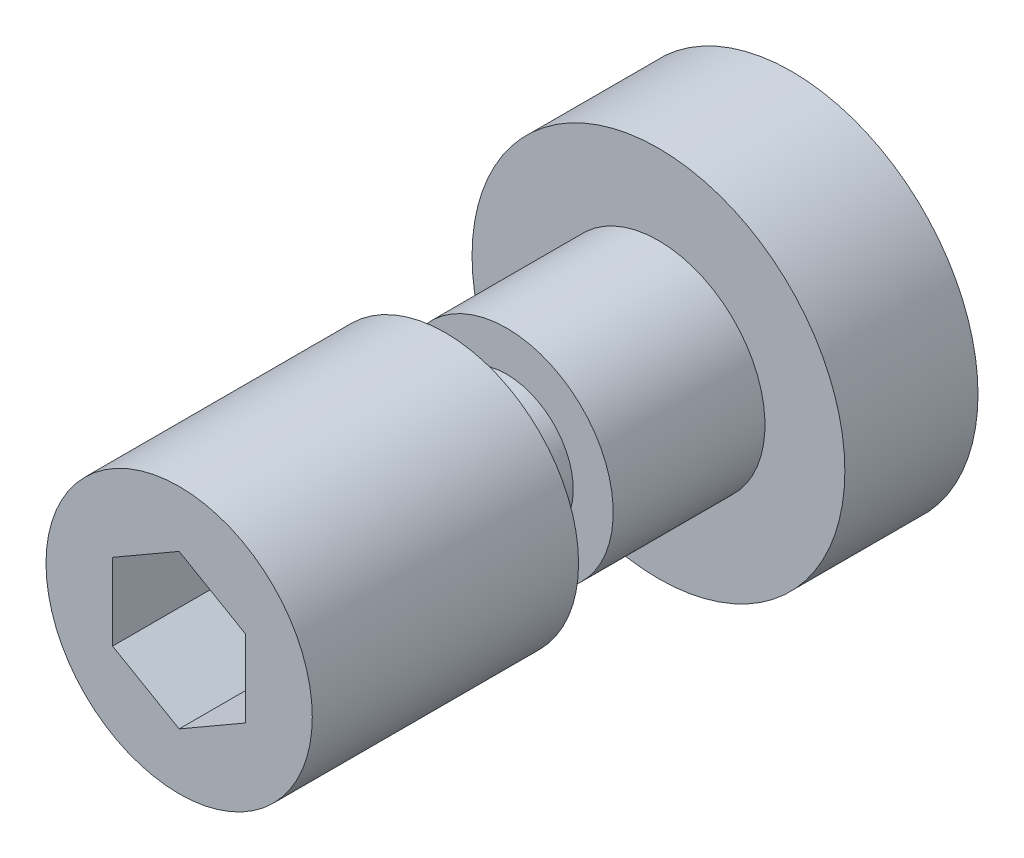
ISO-10303-21;
HEADER;
FILE_DESCRIPTION(('STEP AP214'),'2;1');
FILE_NAME('part.step','',(''),(''),'','','');
FILE_SCHEMA(('AUTOMOTIVE_DESIGN { 1 0 10303 214 1 1 1 1 }'));
ENDSEC;
DATA;
#1=APPLICATION_CONTEXT('core data for automotive mechanical design processes');
#2=APPLICATION_PROTOCOL_DEFINITION('international standard','automotive_design',2000,#1);
#3=PRODUCT_CONTEXT('',#1,'mechanical');
#4=PRODUCT('Part','Part','',(#3));
#5=PRODUCT_RELATED_PRODUCT_CATEGORY('part','',(#4));
#6=PRODUCT_DEFINITION_FORMATION('','',#4);
#7=PRODUCT_DEFINITION_CONTEXT('part definition',#1,'design');
#8=PRODUCT_DEFINITION('design','',#6,#7);
#9=PRODUCT_DEFINITION_SHAPE('','',#8);
#10=(LENGTH_UNIT() NAMED_UNIT(*) SI_UNIT(.MILLI.,.METRE.));
#11=(NAMED_UNIT(*) PLANE_ANGLE_UNIT() SI_UNIT($,.RADIAN.));
#12=(NAMED_UNIT(*) SI_UNIT($,.STERADIAN.) SOLID_ANGLE_UNIT());
#13=UNCERTAINTY_MEASURE_WITH_UNIT(LENGTH_MEASURE(1.E-05),#10,'distance_accuracy_value','');
#14=(GEOMETRIC_REPRESENTATION_CONTEXT(3) GLOBAL_UNCERTAINTY_ASSIGNED_CONTEXT((#13)) GLOBAL_UNIT_ASSIGNED_CONTEXT((#10,
#11,#12)) REPRESENTATION_CONTEXT('',''));
#15=CARTESIAN_POINT('',(0.,0.,0.));
#16=DIRECTION('',(0.,0.,1.));
#17=DIRECTION('',(1.,0.,0.));
#18=AXIS2_PLACEMENT_3D('',#15,#16,#17);
#19=CARTESIAN_POINT('',(0.,0.,0.));
#20=DIRECTION('',(0.,0.,1.));
#21=DIRECTION('',(0.,1.,0.));
#22=AXIS2_PLACEMENT_3D('',#19,#20,#21);
#23=PLANE('',#22);
#24=CARTESIAN_POINT('',(0.,0.,0.));
#25=DIRECTION('',(0.,0.,1.));
#26=DIRECTION('',(0.,1.,0.));
#27=AXIS2_PLACEMENT_3D('',#24,#25,#26);
#28=CIRCLE('',#27,7.);
#29=CARTESIAN_POINT('',(0.,7.,0.));
#30=VERTEX_POINT('',#29);
#31=EDGE_CURVE('E9',#30,#30,#28,.T.);
#32=ORIENTED_EDGE('',*,*,#31,.F.);
#33=EDGE_LOOP('',(#32));
#34=FACE_BOUND('',#33,.T.);
#35=ADVANCED_FACE('F14',(#34),#23,.F.);
#36=CARTESIAN_POINT('',(0.,0.,40.));
#37=DIRECTION('',(0.,0.,1.));
#38=DIRECTION('',(0.,1.,0.));
#39=AXIS2_PLACEMENT_3D('',#36,#37,#38);
#40=CYLINDRICAL_SURFACE('',#39,7.);
#41=CARTESIAN_POINT('',(0.,0.,5.));
#42=DIRECTION('',(0.,0.,1.));
#43=DIRECTION('',(0.,1.,0.));
#44=AXIS2_PLACEMENT_3D('',#41,#42,#43);
#45=CIRCLE('',#44,7.);
#46=CARTESIAN_POINT('',(0.,7.,5.));
#47=VERTEX_POINT('',#46);
#48=EDGE_CURVE('E21',#47,#47,#45,.T.);
#49=ORIENTED_EDGE('',*,*,#48,.F.);
#50=EDGE_LOOP('',(#49));
#51=FACE_BOUND('',#50,.T.);
#52=ORIENTED_EDGE('',*,*,#31,.T.);
#53=EDGE_LOOP('',(#52));
#54=FACE_BOUND('',#53,.T.);
#55=ADVANCED_FACE('F142',(#51,#54),#40,.T.);
#56=CARTESIAN_POINT('',(0.,-7.,5.));
#57=DIRECTION('',(0.,0.,-1.));
#58=DIRECTION('',(0.,-1.,0.));
#59=AXIS2_PLACEMENT_3D('',#56,#57,#58);
#60=PLANE('',#59);
#61=CARTESIAN_POINT('',(0.,0.,5.));
#62=DIRECTION('',(0.,0.,1.));
#63=DIRECTION('',(0.,1.,0.));
#64=AXIS2_PLACEMENT_3D('',#61,#62,#63);
#65=CIRCLE('',#64,4.);
#66=CARTESIAN_POINT('',(0.,4.,5.));
#67=VERTEX_POINT('',#66);
#68=EDGE_CURVE('E135',#67,#67,#65,.T.);
#69=ORIENTED_EDGE('',*,*,#68,.F.);
#70=EDGE_LOOP('',(#69));
#71=FACE_BOUND('',#70,.T.);
#72=ORIENTED_EDGE('',*,*,#48,.T.);
#73=EDGE_LOOP('',(#72));
#74=FACE_BOUND('',#73,.T.);
#75=ADVANCED_FACE('F140',(#71,#74),#60,.F.);
#76=CARTESIAN_POINT('',(0.,0.,40.));
#77=DIRECTION('',(0.,0.,1.));
#78=DIRECTION('',(0.,1.,0.));
#79=AXIS2_PLACEMENT_3D('',#76,#77,#78);
#80=CYLINDRICAL_SURFACE('',#79,4.);
#81=CARTESIAN_POINT('',(0.,0.,10.7));
#82=DIRECTION('',(0.,0.,1.));
#83=DIRECTION('',(0.,1.,0.));
#84=AXIS2_PLACEMENT_3D('',#81,#82,#83);
#85=CIRCLE('',#84,4.);
#86=CARTESIAN_POINT('',(0.,4.,10.7));
#87=VERTEX_POINT('',#86);
#88=EDGE_CURVE('E132',#87,#87,#85,.T.);
#89=ORIENTED_EDGE('',*,*,#88,.F.);
#90=EDGE_LOOP('',(#89));
#91=FACE_BOUND('',#90,.T.);
#92=ORIENTED_EDGE('',*,*,#68,.T.);
#93=EDGE_LOOP('',(#92));
#94=FACE_BOUND('',#93,.T.);
#95=ADVANCED_FACE('F165',(#91,#94),#80,.T.);
#96=CARTESIAN_POINT('',(0.,-4.,10.7));
#97=DIRECTION('',(0.,0.,-1.));
#98=DIRECTION('',(0.,-1.,0.));
#99=AXIS2_PLACEMENT_3D('',#96,#97,#98);
#100=PLANE('',#99);
#101=CARTESIAN_POINT('',(0.,0.,10.7));
#102=DIRECTION('',(0.,0.,1.));
#103=DIRECTION('',(0.,1.,0.));
#104=AXIS2_PLACEMENT_3D('',#101,#102,#103);
#105=CIRCLE('',#104,2.5);
#106=CARTESIAN_POINT('',(0.,2.5,10.7));
#107=VERTEX_POINT('',#106);
#108=EDGE_CURVE('E129',#107,#107,#105,.T.);
#109=ORIENTED_EDGE('',*,*,#108,.F.);
#110=EDGE_LOOP('',(#109));
#111=FACE_BOUND('',#110,.T.);
#112=ORIENTED_EDGE('',*,*,#88,.T.);
#113=EDGE_LOOP('',(#112));
#114=FACE_BOUND('',#113,.T.);
#115=ADVANCED_FACE('F174',(#111,#114),#100,.F.);
#116=CARTESIAN_POINT('',(0.,0.,40.));
#117=DIRECTION('',(0.,0.,1.));
#118=DIRECTION('',(0.,1.,0.));
#119=AXIS2_PLACEMENT_3D('',#116,#117,#118);
#120=CYLINDRICAL_SURFACE('',#119,2.5);
#121=CARTESIAN_POINT('',(0.,0.,13.));
#122=DIRECTION('',(0.,0.,1.));
#123=DIRECTION('',(0.,1.,0.));
#124=AXIS2_PLACEMENT_3D('',#121,#122,#123);
#125=CIRCLE('',#124,2.5);
#126=CARTESIAN_POINT('',(0.,2.5,13.));
#127=VERTEX_POINT('',#126);
#128=EDGE_CURVE('E126',#127,#127,#125,.T.);
#129=ORIENTED_EDGE('',*,*,#128,.F.);
#130=EDGE_LOOP('',(#129));
#131=FACE_BOUND('',#130,.T.);
#132=ORIENTED_EDGE('',*,*,#108,.T.);
#133=EDGE_LOOP('',(#132));
#134=FACE_BOUND('',#133,.T.);
#135=ADVANCED_FACE('F183',(#131,#134),#120,.T.);
#136=CARTESIAN_POINT('',(0.,-2.5,13.));
#137=DIRECTION('',(0.,0.,1.));
#138=DIRECTION('',(0.,1.,0.));
#139=AXIS2_PLACEMENT_3D('',#136,#137,#138);
#140=PLANE('',#139);
#141=CARTESIAN_POINT('',(0.,0.,13.));
#142=DIRECTION('',(0.,0.,1.));
#143=DIRECTION('',(0.,1.,0.));
#144=AXIS2_PLACEMENT_3D('',#141,#142,#143);
#145=CIRCLE('',#144,5.);
#146=CARTESIAN_POINT('',(0.,5.,13.));
#147=VERTEX_POINT('',#146);
#148=EDGE_CURVE('E123',#147,#147,#145,.T.);
#149=ORIENTED_EDGE('',*,*,#148,.F.);
#150=EDGE_LOOP('',(#149));
#151=FACE_BOUND('',#150,.T.);
#152=ORIENTED_EDGE('',*,*,#128,.T.);
#153=EDGE_LOOP('',(#152));
#154=FACE_BOUND('',#153,.T.);
#155=ADVANCED_FACE('F192',(#151,#154),#140,.F.);
#156=CARTESIAN_POINT('',(0.,0.,40.));
#157=DIRECTION('',(0.,0.,1.));
#158=DIRECTION('',(0.,1.,0.));
#159=AXIS2_PLACEMENT_3D('',#156,#157,#158);
#160=CYLINDRICAL_SURFACE('',#159,5.);
#161=CARTESIAN_POINT('',(0.,0.,23.));
#162=DIRECTION('',(0.,0.,1.));
#163=DIRECTION('',(0.,1.,0.));
#164=AXIS2_PLACEMENT_3D('',#161,#162,#163);
#165=CIRCLE('',#164,5.);
#166=CARTESIAN_POINT('',(0.,5.,23.));
#167=VERTEX_POINT('',#166);
#168=EDGE_CURVE('E115',#167,#167,#165,.T.);
#169=ORIENTED_EDGE('',*,*,#168,.F.);
#170=EDGE_LOOP('',(#169));
#171=FACE_BOUND('',#170,.T.);
#172=ORIENTED_EDGE('',*,*,#148,.T.);
#173=EDGE_LOOP('',(#172));
#174=FACE_BOUND('',#173,.T.);
#175=ADVANCED_FACE('F201',(#171,#174),#160,.T.);
#176=CARTESIAN_POINT('',(0.,-5.,23.));
#177=DIRECTION('',(0.,0.,-1.));
#178=DIRECTION('',(0.,-1.,0.));
#179=AXIS2_PLACEMENT_3D('',#176,#177,#178);
#180=PLANE('',#179);
#181=DIRECTION('',(-0.866025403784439,-0.5,0.));
#182=VECTOR('',#181,1.);
#183=CARTESIAN_POINT('',(0.,2.88675134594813,23.));
#184=LINE('',#183,#182);
#185=CARTESIAN_POINT('',(0.,2.88675134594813,23.));
#186=VERTEX_POINT('',#185);
#187=CARTESIAN_POINT('',(-2.5,1.44337567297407,23.));
#188=VERTEX_POINT('',#187);
#189=EDGE_CURVE('E102',#186,#188,#184,.T.);
#190=ORIENTED_EDGE('',*,*,#189,.F.);
#191=DIRECTION('',(-0.866025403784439,0.5,0.));
#192=VECTOR('',#191,1.);
#193=CARTESIAN_POINT('',(2.5,1.44337567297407,23.));
#194=LINE('',#193,#192);
#195=CARTESIAN_POINT('',(2.5,1.44337567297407,23.));
#196=VERTEX_POINT('',#195);
#197=EDGE_CURVE('E28',#196,#186,#194,.T.);
#198=ORIENTED_EDGE('',*,*,#197,.F.);
#199=DIRECTION('',(0.,1.,0.));
#200=VECTOR('',#199,1.);
#201=CARTESIAN_POINT('',(2.5,-1.44337567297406,23.));
#202=LINE('',#201,#200);
#203=CARTESIAN_POINT('',(2.5,-1.44337567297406,23.));
#204=VERTEX_POINT('',#203);
#205=EDGE_CURVE('E111',#204,#196,#202,.T.);
#206=ORIENTED_EDGE('',*,*,#205,.F.);
#207=DIRECTION('',(0.866025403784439,0.5,0.));
#208=VECTOR('',#207,1.);
#209=CARTESIAN_POINT('',(0.,-2.88675134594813,23.));
#210=LINE('',#209,#208);
#211=CARTESIAN_POINT('',(0.,-2.88675134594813,23.));
#212=VERTEX_POINT('',#211);
#213=EDGE_CURVE('E109',#212,#204,#210,.T.);
#214=ORIENTED_EDGE('',*,*,#213,.F.);
#215=DIRECTION('',(0.866025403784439,-0.5,0.));
#216=VECTOR('',#215,1.);
#217=CARTESIAN_POINT('',(-2.5,-1.44337567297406,23.));
#218=LINE('',#217,#216);
#219=CARTESIAN_POINT('',(-2.5,-1.44337567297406,23.));
#220=VERTEX_POINT('',#219);
#221=EDGE_CURVE('E76',#220,#212,#218,.T.);
#222=ORIENTED_EDGE('',*,*,#221,.F.);
#223=DIRECTION('',(0.,-1.,0.));
#224=VECTOR('',#223,1.);
#225=CARTESIAN_POINT('',(-2.5,1.44337567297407,23.));
#226=LINE('',#225,#224);
#227=EDGE_CURVE('E105',#188,#220,#226,.T.);
#228=ORIENTED_EDGE('',*,*,#227,.F.);
#229=EDGE_LOOP('',(#190,#198,#206,#214,#222,#228));
#230=FACE_BOUND('',#229,.T.);
#231=ORIENTED_EDGE('',*,*,#168,.T.);
#232=EDGE_LOOP('',(#231));
#233=FACE_BOUND('',#232,.T.);
#234=ADVANCED_FACE('F210',(#230,#233),#180,.F.);
#235=CARTESIAN_POINT('',(2.5,1.44337567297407,17.));
#236=DIRECTION('',(0.5,0.866025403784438,0.));
#237=DIRECTION('',(-0.866025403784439,0.5,0.));
#238=AXIS2_PLACEMENT_3D('',#235,#236,#237);
#239=PLANE('',#238);
#240=ORIENTED_EDGE('',*,*,#197,.T.);
#241=DIRECTION('',(0.,0.,1.));
#242=VECTOR('',#241,1.);
#243=CARTESIAN_POINT('',(0.,2.88675134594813,17.));
#244=LINE('',#243,#242);
#245=CARTESIAN_POINT('',(0.,2.88675134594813,17.));
#246=VERTEX_POINT('',#245);
#247=EDGE_CURVE('E58',#246,#186,#244,.T.);
#248=ORIENTED_EDGE('',*,*,#247,.F.);
#249=DIRECTION('',(-0.866025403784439,0.5,0.));
#250=VECTOR('',#249,1.);
#251=CARTESIAN_POINT('',(2.5,1.44337567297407,17.));
#252=LINE('',#251,#250);
#253=CARTESIAN_POINT('',(2.5,1.44337567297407,17.));
#254=VERTEX_POINT('',#253);
#255=EDGE_CURVE('E113',#254,#246,#252,.T.);
#256=ORIENTED_EDGE('',*,*,#255,.F.);
#257=DIRECTION('',(0.,0.,1.));
#258=VECTOR('',#257,1.);
#259=CARTESIAN_POINT('',(2.5,1.44337567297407,17.));
#260=LINE('',#259,#258);
#261=EDGE_CURVE('E36',#254,#196,#260,.T.);
#262=ORIENTED_EDGE('',*,*,#261,.T.);
#263=EDGE_LOOP('',(#240,#248,#256,#262));
#264=FACE_BOUND('',#263,.T.);
#265=ADVANCED_FACE('F219',(#264),#239,.F.);
#266=CARTESIAN_POINT('',(2.5,-1.44337567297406,17.));
#267=DIRECTION('',(1.,0.,0.));
#268=DIRECTION('',(0.,1.,0.));
#269=AXIS2_PLACEMENT_3D('',#266,#267,#268);
#270=PLANE('',#269);
#271=ORIENTED_EDGE('',*,*,#205,.T.);
#272=ORIENTED_EDGE('',*,*,#261,.F.);
#273=DIRECTION('',(0.,1.,0.));
#274=VECTOR('',#273,1.);
#275=CARTESIAN_POINT('',(2.5,-1.44337567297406,17.));
#276=LINE('',#275,#274);
#277=CARTESIAN_POINT('',(2.5,-1.44337567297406,17.));
#278=VERTEX_POINT('',#277);
#279=EDGE_CURVE('E88',#278,#254,#276,.T.);
#280=ORIENTED_EDGE('',*,*,#279,.F.);
#281=DIRECTION('',(0.,0.,1.));
#282=VECTOR('',#281,1.);
#283=CARTESIAN_POINT('',(2.5,-1.44337567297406,17.));
#284=LINE('',#283,#282);
#285=EDGE_CURVE('E80',#278,#204,#284,.T.);
#286=ORIENTED_EDGE('',*,*,#285,.T.);
#287=EDGE_LOOP('',(#271,#272,#280,#286));
#288=FACE_BOUND('',#287,.T.);
#289=ADVANCED_FACE('F228',(#288),#270,.F.);
#290=CARTESIAN_POINT('',(0.,-2.88675134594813,17.));
#291=DIRECTION('',(0.5,-0.866025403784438,0.));
#292=DIRECTION('',(0.866025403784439,0.5,0.));
#293=AXIS2_PLACEMENT_3D('',#290,#291,#292);
#294=PLANE('',#293);
#295=ORIENTED_EDGE('',*,*,#213,.T.);
#296=ORIENTED_EDGE('',*,*,#285,.F.);
#297=DIRECTION('',(0.866025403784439,0.5,0.));
#298=VECTOR('',#297,1.);
#299=CARTESIAN_POINT('',(0.,-2.88675134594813,17.));
#300=LINE('',#299,#298);
#301=CARTESIAN_POINT('',(0.,-2.88675134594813,17.));
#302=VERTEX_POINT('',#301);
#303=EDGE_CURVE('E84',#302,#278,#300,.T.);
#304=ORIENTED_EDGE('',*,*,#303,.F.);
#305=DIRECTION('',(0.,0.,1.));
#306=VECTOR('',#305,1.);
#307=CARTESIAN_POINT('',(0.,-2.88675134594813,17.));
#308=LINE('',#307,#306);
#309=EDGE_CURVE('E69',#302,#212,#308,.T.);
#310=ORIENTED_EDGE('',*,*,#309,.T.);
#311=EDGE_LOOP('',(#295,#296,#304,#310));
#312=FACE_BOUND('',#311,.T.);
#313=ADVANCED_FACE('F85',(#312),#294,.F.);
#314=CARTESIAN_POINT('',(-2.5,-1.44337567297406,17.));
#315=DIRECTION('',(-0.5,-0.866025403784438,0.));
#316=DIRECTION('',(0.866025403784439,-0.5,0.));
#317=AXIS2_PLACEMENT_3D('',#314,#315,#316);
#318=PLANE('',#317);
#319=ORIENTED_EDGE('',*,*,#221,.T.);
#320=ORIENTED_EDGE('',*,*,#309,.F.);
#321=DIRECTION('',(0.866025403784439,-0.5,0.));
#322=VECTOR('',#321,1.);
#323=CARTESIAN_POINT('',(-2.5,-1.44337567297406,17.));
#324=LINE('',#323,#322);
#325=CARTESIAN_POINT('',(-2.5,-1.44337567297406,17.));
#326=VERTEX_POINT('',#325);
#327=EDGE_CURVE('E73',#326,#302,#324,.T.);
#328=ORIENTED_EDGE('',*,*,#327,.F.);
#329=DIRECTION('',(0.,0.,1.));
#330=VECTOR('',#329,1.);
#331=CARTESIAN_POINT('',(-2.5,-1.44337567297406,17.));
#332=LINE('',#331,#330);
#333=EDGE_CURVE('E81',#326,#220,#332,.T.);
#334=ORIENTED_EDGE('',*,*,#333,.T.);
#335=EDGE_LOOP('',(#319,#320,#328,#334));
#336=FACE_BOUND('',#335,.T.);
#337=ADVANCED_FACE('F71',(#336),#318,.F.);
#338=CARTESIAN_POINT('',(-2.5,1.44337567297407,17.));
#339=DIRECTION('',(-1.,0.,0.));
#340=DIRECTION('',(0.,-1.,0.));
#341=AXIS2_PLACEMENT_3D('',#338,#339,#340);
#342=PLANE('',#341);
#343=ORIENTED_EDGE('',*,*,#227,.T.);
#344=ORIENTED_EDGE('',*,*,#333,.F.);
#345=DIRECTION('',(0.,-1.,0.));
#346=VECTOR('',#345,1.);
#347=CARTESIAN_POINT('',(-2.5,1.44337567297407,17.));
#348=LINE('',#347,#346);
#349=CARTESIAN_POINT('',(-2.5,1.44337567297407,17.));
#350=VERTEX_POINT('',#349);
#351=EDGE_CURVE('E94',#350,#326,#348,.T.);
#352=ORIENTED_EDGE('',*,*,#351,.F.);
#353=DIRECTION('',(0.,0.,1.));
#354=VECTOR('',#353,1.);
#355=CARTESIAN_POINT('',(-2.5,1.44337567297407,17.));
#356=LINE('',#355,#354);
#357=EDGE_CURVE('E118',#350,#188,#356,.T.);
#358=ORIENTED_EDGE('',*,*,#357,.T.);
#359=EDGE_LOOP('',(#343,#344,#352,#358));
#360=FACE_BOUND('',#359,.T.);
#361=ADVANCED_FACE('F250',(#360),#342,.F.);
#362=CARTESIAN_POINT('',(0.,2.88675134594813,17.));
#363=DIRECTION('',(-0.5,0.866025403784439,0.));
#364=DIRECTION('',(-0.866025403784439,-0.5,0.));
#365=AXIS2_PLACEMENT_3D('',#362,#363,#364);
#366=PLANE('',#365);
#367=ORIENTED_EDGE('',*,*,#189,.T.);
#368=ORIENTED_EDGE('',*,*,#357,.F.);
#369=DIRECTION('',(-0.866025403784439,-0.5,0.));
#370=VECTOR('',#369,1.);
#371=CARTESIAN_POINT('',(0.,2.88675134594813,17.));
#372=LINE('',#371,#370);
#373=EDGE_CURVE('E96',#246,#350,#372,.T.);
#374=ORIENTED_EDGE('',*,*,#373,.F.);
#375=ORIENTED_EDGE('',*,*,#247,.T.);
#376=EDGE_LOOP('',(#367,#368,#374,#375));
#377=FACE_BOUND('',#376,.T.);
#378=ADVANCED_FACE('F258',(#377),#366,.F.);
#379=CARTESIAN_POINT('',(0.,2.88675134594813,17.));
#380=DIRECTION('',(0.,0.,1.));
#381=DIRECTION('',(1.,0.,0.));
#382=AXIS2_PLACEMENT_3D('',#379,#380,#381);
#383=PLANE('',#382);
#384=ORIENTED_EDGE('',*,*,#255,.T.);
#385=ORIENTED_EDGE('',*,*,#373,.T.);
#386=ORIENTED_EDGE('',*,*,#351,.T.);
#387=ORIENTED_EDGE('',*,*,#327,.T.);
#388=ORIENTED_EDGE('',*,*,#303,.T.);
#389=ORIENTED_EDGE('',*,*,#279,.T.);
#390=EDGE_LOOP('',(#384,#385,#386,#387,#388,#389));
#391=FACE_BOUND('',#390,.T.);
#392=ADVANCED_FACE('F91',(#391),#383,.T.);
#393=CLOSED_SHELL('',(#35,#55,#75,#95,#115,#135,#155,#175,#234,#265,#289,#313,#337,#361,#378,#392));
#394=MANIFOLD_SOLID_BREP('B1',#393);
#395=ADVANCED_BREP_SHAPE_REPRESENTATION('',(#18,#394),#14);
#396=SHAPE_DEFINITION_REPRESENTATION(#9,#395);
ENDSEC;
END-ISO-10303-21;
